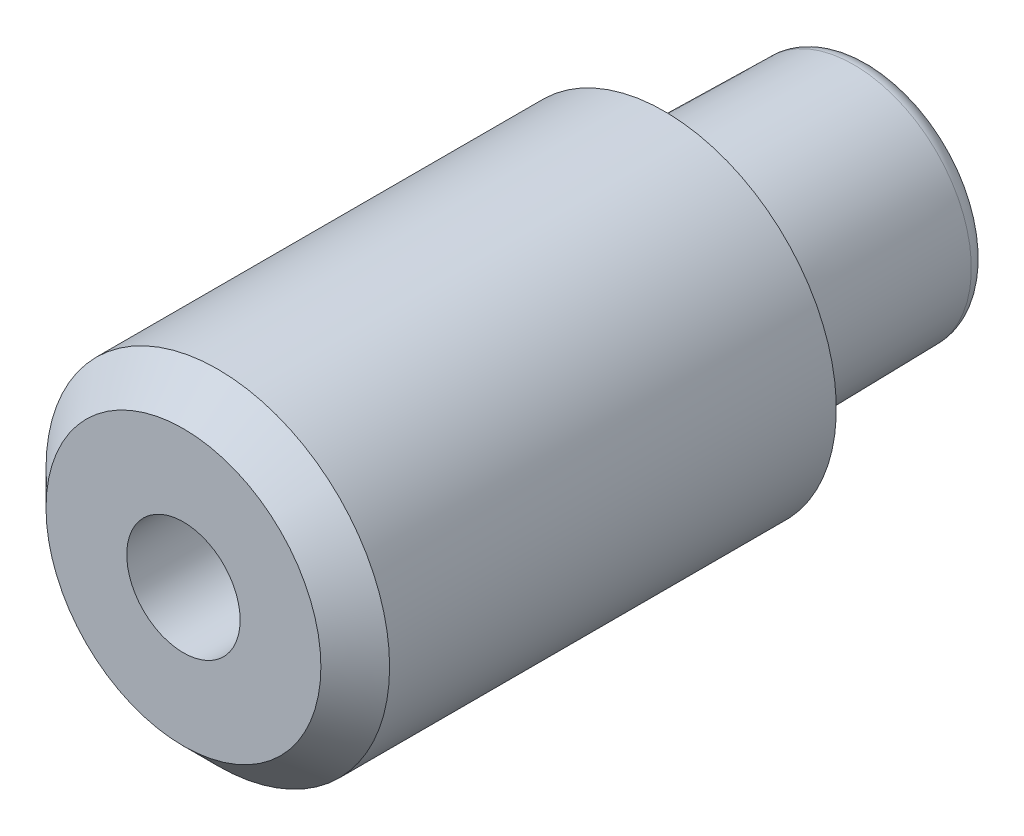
ISO-10303-21;
HEADER;
FILE_DESCRIPTION(('STEP AP214'),'2;1');
FILE_NAME('part.step','',(''),(''),'','','');
FILE_SCHEMA(('AUTOMOTIVE_DESIGN { 1 0 10303 214 1 1 1 1 }'));
ENDSEC;
DATA;
#1=APPLICATION_CONTEXT('core data for automotive mechanical design processes');
#2=APPLICATION_PROTOCOL_DEFINITION('international standard','automotive_design',2000,#1);
#3=PRODUCT_CONTEXT('',#1,'mechanical');
#4=PRODUCT('Part','Part','',(#3));
#5=PRODUCT_RELATED_PRODUCT_CATEGORY('part','',(#4));
#6=PRODUCT_DEFINITION_FORMATION('','',#4);
#7=PRODUCT_DEFINITION_CONTEXT('part definition',#1,'design');
#8=PRODUCT_DEFINITION('design','',#6,#7);
#9=PRODUCT_DEFINITION_SHAPE('','',#8);
#10=(LENGTH_UNIT() NAMED_UNIT(*) SI_UNIT(.MILLI.,.METRE.));
#11=(NAMED_UNIT(*) PLANE_ANGLE_UNIT() SI_UNIT($,.RADIAN.));
#12=(NAMED_UNIT(*) SI_UNIT($,.STERADIAN.) SOLID_ANGLE_UNIT());
#13=UNCERTAINTY_MEASURE_WITH_UNIT(LENGTH_MEASURE(1.E-05),#10,'distance_accuracy_value','');
#14=(GEOMETRIC_REPRESENTATION_CONTEXT(3) GLOBAL_UNCERTAINTY_ASSIGNED_CONTEXT((#13)) GLOBAL_UNIT_ASSIGNED_CONTEXT((#10,
#11,#12)) REPRESENTATION_CONTEXT('',''));
#15=CARTESIAN_POINT('',(0.,0.,0.));
#16=DIRECTION('',(0.,0.,1.));
#17=DIRECTION('',(1.,0.,0.));
#18=AXIS2_PLACEMENT_3D('',#15,#16,#17);
#19=CARTESIAN_POINT('',(0.,0.,11.9289321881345));
#20=DIRECTION('',(0.,0.,-1.));
#21=DIRECTION('',(1.,0.,0.));
#22=AXIS2_PLACEMENT_3D('',#19,#20,#21);
#23=CONICAL_SURFACE('',#22,7.07106781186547,0.785398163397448);
#24=CARTESIAN_POINT('',(1.04744440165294E-13,0.,15.));
#25=DIRECTION('',(0.,0.,-1.));
#26=DIRECTION('',(-1.,0.,0.));
#27=AXIS2_PLACEMENT_3D('',#24,#25,#26);
#28=CIRCLE('',#27,4.);
#29=CARTESIAN_POINT('',(-3.9999999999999,0.,15.));
#30=VERTEX_POINT('',#29);
#31=CARTESIAN_POINT('',(4.0000000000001,0.,15.));
#32=VERTEX_POINT('',#31);
#33=EDGE_CURVE('E59',#30,#32,#28,.T.);
#34=ORIENTED_EDGE('',*,*,#33,.T.);
#35=CARTESIAN_POINT('',(4.00000161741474,0.,14.9999983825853));
#36=CARTESIAN_POINT('',(5.00000126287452,0.,13.9999987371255));
#37=B_SPLINE_CURVE_WITH_KNOTS('',1,(#35,#36),.UNSPECIFIED.,.F.,.F.,(2,2),(0.56568565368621,
0.707106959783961),.UNSPECIFIED.);
#38=CARTESIAN_POINT('',(5.0000000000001,0.,14.));
#39=VERTEX_POINT('',#38);
#40=EDGE_CURVE('E46',#32,#39,#37,.T.);
#41=ORIENTED_EDGE('',*,*,#40,.T.);
#42=CARTESIAN_POINT('',(0.,0.,14.));
#43=DIRECTION('',(0.,0.,1.));
#44=DIRECTION('',(-1.,0.,0.));
#45=AXIS2_PLACEMENT_3D('',#42,#43,#44);
#46=CIRCLE('',#45,5.);
#47=CARTESIAN_POINT('',(-4.9999999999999,0.,14.));
#48=VERTEX_POINT('',#47);
#49=EDGE_CURVE('E97',#39,#48,#46,.T.);
#50=ORIENTED_EDGE('',*,*,#49,.T.);
#51=CARTESIAN_POINT('',(0.,0.,14.));
#52=DIRECTION('',(0.,0.,1.));
#53=DIRECTION('',(-1.,0.,0.));
#54=AXIS2_PLACEMENT_3D('',#51,#52,#53);
#55=CIRCLE('',#54,5.);
#56=EDGE_CURVE('E11',#48,#39,#55,.T.);
#57=ORIENTED_EDGE('',*,*,#56,.T.);
#58=ORIENTED_EDGE('',*,*,#40,.F.);
#59=CARTESIAN_POINT('',(1.04744440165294E-13,0.,15.));
#60=DIRECTION('',(0.,0.,-1.));
#61=DIRECTION('',(-1.,0.,0.));
#62=AXIS2_PLACEMENT_3D('',#59,#60,#61);
#63=CIRCLE('',#62,4.);
#64=EDGE_CURVE('E94',#32,#30,#63,.T.);
#65=ORIENTED_EDGE('',*,*,#64,.T.);
#66=EDGE_LOOP('',(#34,#41,#50,#57,#58,#65));
#67=FACE_BOUND('',#66,.T.);
#68=ADVANCED_FACE('F38',(#67),#23,.T.);
#69=CARTESIAN_POINT('',(0.,0.,8.));
#70=DIRECTION('',(0.,0.,-1.));
#71=DIRECTION('',(-1.,0.,0.));
#72=AXIS2_PLACEMENT_3D('',#69,#70,#71);
#73=CYLINDRICAL_SURFACE('',#72,5.);
#74=ORIENTED_EDGE('',*,*,#49,.F.);
#75=ORIENTED_EDGE('',*,*,#56,.F.);
#76=CARTESIAN_POINT('',(-4.9999999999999,0.,13.9999990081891));
#77=CARTESIAN_POINT('',(-5.,0.,0.999998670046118));
#78=B_SPLINE_CURVE_WITH_KNOTS('',1,(#76,#77),.UNSPECIFIED.,.F.,.F.,(2,2),(0.0833333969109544,
0.916666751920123),.UNSPECIFIED.);
#79=CARTESIAN_POINT('',(-5.,0.,1.00000000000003));
#80=VERTEX_POINT('',#79);
#81=EDGE_CURVE('E132',#48,#80,#78,.T.);
#82=ORIENTED_EDGE('',*,*,#81,.T.);
#83=CARTESIAN_POINT('',(0.,0.,1.));
#84=DIRECTION('',(0.,0.,-1.));
#85=DIRECTION('',(-1.,0.,0.));
#86=AXIS2_PLACEMENT_3D('',#83,#84,#85);
#87=CIRCLE('',#86,5.);
#88=EDGE_CURVE('E137',#80,#80,#87,.T.);
#89=ORIENTED_EDGE('',*,*,#88,.F.);
#90=ORIENTED_EDGE('',*,*,#81,.F.);
#91=EDGE_LOOP('',(#74,#75,#82,#89,#90));
#92=FACE_BOUND('',#91,.T.);
#93=ADVANCED_FACE('F182',(#92),#73,.T.);
#94=CARTESIAN_POINT('',(-5.1999999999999,-8.31384387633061,15.));
#95=DIRECTION('',(0.,0.,1.));
#96=DIRECTION('',(1.,0.,0.));
#97=AXIS2_PLACEMENT_3D('',#94,#95,#96);
#98=PLANE('',#97);
#99=CARTESIAN_POINT('',(0.,0.,15.));
#100=DIRECTION('',(0.,0.,1.));
#101=DIRECTION('',(1.,0.,0.));
#102=AXIS2_PLACEMENT_3D('',#99,#100,#101);
#103=CIRCLE('',#102,1.64999999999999);
#104=CARTESIAN_POINT('',(1.64999999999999,0.,15.));
#105=VERTEX_POINT('',#104);
#106=EDGE_CURVE('E95',#105,#105,#103,.T.);
#107=ORIENTED_EDGE('',*,*,#106,.F.);
#108=EDGE_LOOP('',(#107));
#109=FACE_BOUND('',#108,.T.);
#110=ORIENTED_EDGE('',*,*,#64,.F.);
#111=ORIENTED_EDGE('',*,*,#33,.F.);
#112=EDGE_LOOP('',(#110,#111));
#113=FACE_BOUND('',#112,.T.);
#114=ADVANCED_FACE('F185',(#109,#113),#98,.T.);
#115=CARTESIAN_POINT('',(0.,0.,-4.5));
#116=DIRECTION('',(0.,0.,-1.));
#117=DIRECTION('',(-1.,0.,0.));
#118=AXIS2_PLACEMENT_3D('',#115,#116,#117);
#119=TOROIDAL_SURFACE('',#118,2.92137604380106,0.5);
#120=CARTESIAN_POINT('',(0.,0.,-4.50872620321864));
#121=DIRECTION('',(0.,0.,-1.));
#122=DIRECTION('',(-1.,0.,0.));
#123=AXIS2_PLACEMENT_3D('',#120,#121,#122);
#124=CIRCLE('',#123,3.42129989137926);
#125=CARTESIAN_POINT('',(-3.4212998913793,0.,-4.50872620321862));
#126=VERTEX_POINT('',#125);
#127=EDGE_CURVE('E138',#126,#126,#124,.T.);
#128=ORIENTED_EDGE('',*,*,#127,.T.);
#129=CARTESIAN_POINT('',(-3.4212998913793,0.,-4.50872620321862));
#130=CARTESIAN_POINT('',(-3.41272467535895,0.,-4.99999999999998));
#131=CARTESIAN_POINT('',(-2.9213760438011,0.,-5.));
#132=(BOUNDED_CURVE() B_SPLINE_CURVE(2,(#129,#130,#131),.UNSPECIFIED.,.F.,
.F.) B_SPLINE_CURVE_WITH_KNOTS((3,3),(0.,0.5),
.UNSPECIFIED.) CURVE() GEOMETRIC_REPRESENTATION_ITEM() RATIONAL_B_SPLINE_CURVE((1.,
0.713250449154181,1.)) REPRESENTATION_ITEM(''));
#133=CARTESIAN_POINT('',(-2.9213760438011,0.,-5.));
#134=VERTEX_POINT('',#133);
#135=EDGE_CURVE('E121',#126,#134,#132,.T.);
#136=ORIENTED_EDGE('',*,*,#135,.T.);
#137=CARTESIAN_POINT('',(0.,0.,-5.));
#138=DIRECTION('',(0.,0.,1.));
#139=DIRECTION('',(-1.,0.,0.));
#140=AXIS2_PLACEMENT_3D('',#137,#138,#139);
#141=CIRCLE('',#140,2.92137604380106);
#142=EDGE_CURVE('E127',#134,#134,#141,.T.);
#143=ORIENTED_EDGE('',*,*,#142,.T.);
#144=ORIENTED_EDGE('',*,*,#135,.F.);
#145=EDGE_LOOP('',(#128,#136,#143,#144));
#146=FACE_BOUND('',#145,.T.);
#147=ADVANCED_FACE('F187',(#146),#119,.T.);
#148=CARTESIAN_POINT('',(0.,0.,0.));
#149=DIRECTION('',(0.,0.,1.));
#150=DIRECTION('',(-1.,0.,0.));
#151=AXIS2_PLACEMENT_3D('',#148,#149,#150);
#152=CONICAL_SURFACE('',#151,3.5,0.0174532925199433);
#153=ORIENTED_EDGE('',*,*,#127,.F.);
#154=CARTESIAN_POINT('',(-3.4212998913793,0.,-4.50872620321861));
#155=CARTESIAN_POINT('',(-3.5,0.,0.));
#156=B_SPLINE_CURVE_WITH_KNOTS('',1,(#154,#155),.UNSPECIFIED.,.F.,.F.,(2,2),(0.,1.),.UNSPECIFIED.);
#157=CARTESIAN_POINT('',(-3.5,0.,0.));
#158=VERTEX_POINT('',#157);
#159=EDGE_CURVE('E110',#126,#158,#156,.T.);
#160=ORIENTED_EDGE('',*,*,#159,.T.);
#161=CARTESIAN_POINT('',(0.,0.,0.));
#162=DIRECTION('',(0.,0.,-1.));
#163=DIRECTION('',(-1.,0.,0.));
#164=AXIS2_PLACEMENT_3D('',#161,#162,#163);
#165=CIRCLE('',#164,3.5);
#166=EDGE_CURVE('E116',#158,#158,#165,.T.);
#167=ORIENTED_EDGE('',*,*,#166,.T.);
#168=ORIENTED_EDGE('',*,*,#159,.F.);
#169=EDGE_LOOP('',(#153,#160,#167,#168));
#170=FACE_BOUND('',#169,.T.);
#171=ADVANCED_FACE('F194',(#170),#152,.T.);
#172=CARTESIAN_POINT('',(6.71916490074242,-6.07196608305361,-5.));
#173=DIRECTION('',(0.,0.,-1.));
#174=DIRECTION('',(-1.,0.,0.));
#175=AXIS2_PLACEMENT_3D('',#172,#173,#174);
#176=PLANE('',#175);
#177=ORIENTED_EDGE('',*,*,#142,.F.);
#178=EDGE_LOOP('',(#177));
#179=FACE_BOUND('',#178,.T.);
#180=ADVANCED_FACE('F222',(#179),#176,.T.);
#181=CARTESIAN_POINT('',(0.,0.,0.5));
#182=DIRECTION('',(0.,0.,-1.));
#183=DIRECTION('',(-1.,0.,0.));
#184=AXIS2_PLACEMENT_3D('',#181,#182,#183);
#185=CYLINDRICAL_SURFACE('',#184,3.5);
#186=CARTESIAN_POINT('',(0.,0.,1.));
#187=DIRECTION('',(0.,0.,1.));
#188=DIRECTION('',(-1.,0.,0.));
#189=AXIS2_PLACEMENT_3D('',#186,#187,#188);
#190=CIRCLE('',#189,3.5);
#191=CARTESIAN_POINT('',(-3.5,0.,1.00000000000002));
#192=VERTEX_POINT('',#191);
#193=EDGE_CURVE('E105',#192,#192,#190,.T.);
#194=ORIENTED_EDGE('',*,*,#193,.F.);
#195=CARTESIAN_POINT('',(-3.5,0.,1.00000305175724));
#196=CARTESIAN_POINT('',(-3.5,0.,5.31746900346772E-07));
#197=B_SPLINE_CURVE_WITH_KNOTS('',1,(#195,#196),.UNSPECIFIED.,.F.,.F.,(2,2),(0.0833307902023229,
0.91666622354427),.UNSPECIFIED.);
#198=EDGE_CURVE('E102',#192,#158,#197,.T.);
#199=ORIENTED_EDGE('',*,*,#198,.T.);
#200=ORIENTED_EDGE('',*,*,#166,.F.);
#201=ORIENTED_EDGE('',*,*,#198,.F.);
#202=EDGE_LOOP('',(#194,#199,#200,#201));
#203=FACE_BOUND('',#202,.T.);
#204=ADVANCED_FACE('F231',(#203),#185,.T.);
#205=CARTESIAN_POINT('',(11.5,-10.3923048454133,0.99999999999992));
#206=DIRECTION('',(0.,0.,-1.));
#207=DIRECTION('',(-1.,0.,0.));
#208=AXIS2_PLACEMENT_3D('',#205,#206,#207);
#209=PLANE('',#208);
#210=ORIENTED_EDGE('',*,*,#88,.T.);
#211=EDGE_LOOP('',(#210));
#212=FACE_BOUND('',#211,.T.);
#213=ORIENTED_EDGE('',*,*,#193,.T.);
#214=EDGE_LOOP('',(#213));
#215=FACE_BOUND('',#214,.T.);
#216=ADVANCED_FACE('F88',(#212,#215),#209,.T.);
#217=CARTESIAN_POINT('',(0.,0.,2.99999999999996));
#218=DIRECTION('',(0.,0.,1.));
#219=DIRECTION('',(1.,0.,0.));
#220=AXIS2_PLACEMENT_3D('',#217,#218,#219);
#221=CONICAL_SURFACE('',#220,1.65,1.02974425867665);
#222=CARTESIAN_POINT('',(0.,0.,2.00857997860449));
#223=VERTEX_POINT('',#222);
#224=VERTEX_LOOP('',#223);
#225=FACE_BOUND('',#224,.T.);
#226=CARTESIAN_POINT('',(0.,0.,2.99999999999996));
#227=DIRECTION('',(0.,0.,1.));
#228=DIRECTION('',(1.,0.,0.));
#229=AXIS2_PLACEMENT_3D('',#226,#227,#228);
#230=CIRCLE('',#229,1.65);
#231=CARTESIAN_POINT('',(1.65,0.,2.99999999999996));
#232=VERTEX_POINT('',#231);
#233=EDGE_CURVE('E92',#232,#232,#230,.T.);
#234=ORIENTED_EDGE('',*,*,#233,.T.);
#235=EDGE_LOOP('',(#234));
#236=FACE_BOUND('',#235,.T.);
#237=ADVANCED_FACE('F84',(#225,#236),#221,.F.);
#238=CARTESIAN_POINT('',(0.,0.,15.));
#239=DIRECTION('',(0.,0.,1.));
#240=DIRECTION('',(1.,0.,0.));
#241=AXIS2_PLACEMENT_3D('',#238,#239,#240);
#242=CYLINDRICAL_SURFACE('',#241,1.64999999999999);
#243=ORIENTED_EDGE('',*,*,#233,.F.);
#244=EDGE_LOOP('',(#243));
#245=FACE_BOUND('',#244,.T.);
#246=ORIENTED_EDGE('',*,*,#106,.T.);
#247=EDGE_LOOP('',(#246));
#248=FACE_BOUND('',#247,.T.);
#249=ADVANCED_FACE('F87',(#245,#248),#242,.F.);
#250=CLOSED_SHELL('',(#68,#93,#114,#147,#171,#180,#204,#216,#237,#249));
#251=MANIFOLD_SOLID_BREP('B2',#250);
#252=ADVANCED_BREP_SHAPE_REPRESENTATION('',(#18,#251),#14);
#253=SHAPE_DEFINITION_REPRESENTATION(#9,#252);
ENDSEC;
END-ISO-10303-21;
